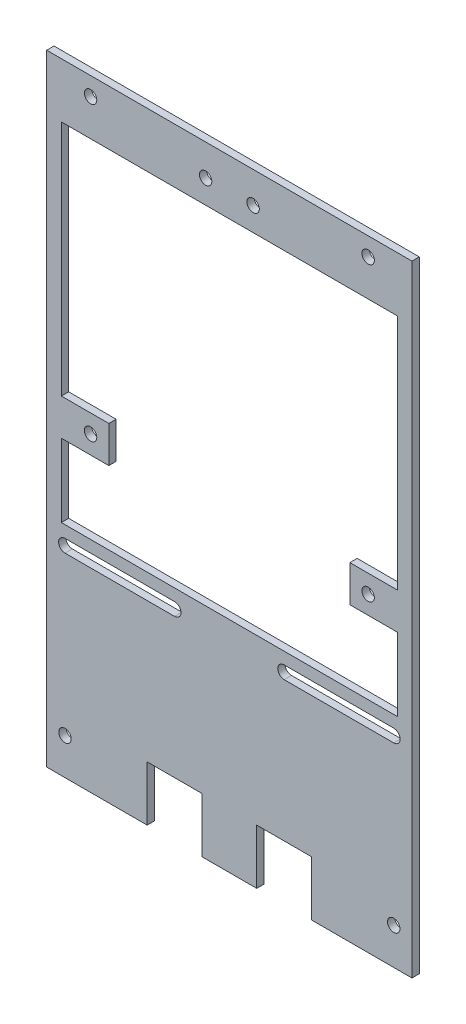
from build123d import *

# Parameters (mm, degrees)
SKETCH_1_W              = 100
SKETCH_1_H              = 170
EXTRUDE_1_DEPTH         = 2
SKETCH_2_W              = 15
SKETCH_2_H              = 30
CUT_EXTRUDE_1_DEPTH     = 3
HOLE_WIZARD_3_4_3_4_1_D = 3.4
HOLE_WIZARD_3_4_3_4_2_D = 3.4
HOLE_WIZARD_3_4_3_4_3_D = 3.4
CUT_EXTRUDE_2_REACH     = 100.636
CUT_EXTRUDE_3_REACH     = 100.636


with BuildPart() as part:
    # Sketch 1 → Extrude 1 (new body)
    with BuildSketch(Plane.XY):
        Rectangle(SKETCH_1_W, SKETCH_1_H)
    extrude(amount=EXTRUDE_1_DEPTH)

    # Sketch 2 → Cut-Extrude 1 (cut)
    with BuildSketch(Plane.XY.offset(2)):
        with Locations((-15, -85)):
            Rectangle(SKETCH_2_W, SKETCH_2_H)
        with Locations((15, -85)):
            Rectangle(SKETCH_2_W, SKETCH_2_H)
    extrude(amount=-CUT_EXTRUDE_1_DEPTH, mode=Mode.SUBTRACT)

    # Hole Wizard 3.4 _3.4_ _1 (through all)
    with Locations(Plane.XY.offset(2)):
        with Locations((-6.499991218, 76.443638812), (6.500008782, 76.443638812)):
            Hole(HOLE_WIZARD_3_4_3_4_1_D / 2)

    # Hole Wizard 3.4 _3.4_ _2 (through all)
    with Locations(Plane.XY.offset(2)):
        with Locations((-45, -75), (45, -75)):
            Hole(HOLE_WIZARD_3_4_3_4_2_D / 2)

    # Hole Wizard 3.4 _3.4_ _3 (through all)
    with Locations(Plane.XY.offset(2)):
        with Locations((-38, 80), (38, 80), (-38, 0), (38, 0)):
            Hole(HOLE_WIZARD_3_4_3_4_3_D / 2)

    # Sketch 9 → Cut-Extrude 2 (cut, up to next)
    with BuildSketch(Plane.XY.offset(2), mode=Mode.PRIVATE) as cut_extrude_2_sk1:
        Polygon((-46, 5), (-33, 5), (33, 5), (46, 5), (46, 70), (33, 70), (-33, 70), (-46, 70), align=None)
    cut_extrude_2_tool1 = extrude(cut_extrude_2_sk1.sketch, amount=-CUT_EXTRUDE_2_REACH, mode=Mode.PRIVATE) & part.part
    # Sketch 9 → Cut-Extrude 2 (cut, up to next)
    with BuildSketch(Plane.XY.offset(2), mode=Mode.PRIVATE) as cut_extrude_2_sk2:
        Polygon((-33, -5), (-46, -5), (-46, -25), (46, -25), (46, -5), (33, -5), (33, 5), (-33, 5), align=None)
    cut_extrude_2_tool2 = extrude(cut_extrude_2_sk2.sketch, amount=-CUT_EXTRUDE_2_REACH, mode=Mode.PRIVATE) & part.part
    add(cut_extrude_2_tool1.solids().sort_by_distance((0, 37.5, 2))[0], mode=Mode.SUBTRACT)
    add(cut_extrude_2_tool2.solids().sort_by_distance((0, -11.04, 2))[0], mode=Mode.SUBTRACT)

    # Sketch 10 → Cut-Extrude 3 (cut, up to next)
    with BuildSketch(Plane.XY.offset(2), mode=Mode.PRIVATE) as cut_extrude_3_sk1:
        with BuildLine():
            Line((-45, -28.25), (-15, -28.25))
            ThreePointArc((-15, -28.25), (-13.25, -30), (-15, -31.75))
            Line((-15, -31.75), (-45, -31.75))
            ThreePointArc((-45, -31.75), (-46.75, -30), (-45, -28.25))
        make_face()
    cut_extrude_3_tool1 = extrude(cut_extrude_3_sk1.sketch, amount=-CUT_EXTRUDE_3_REACH, mode=Mode.PRIVATE) & part.part
    # Sketch 10 → Cut-Extrude 3 (cut, up to next)
    with BuildSketch(Plane.XY.offset(2), mode=Mode.PRIVATE) as cut_extrude_3_sk2:
        with BuildLine():
            Line((15, -28.25), (45, -28.25))
            ThreePointArc((45, -28.25), (46.75, -30), (45, -31.75))
            Line((45, -31.75), (15, -31.75))
            ThreePointArc((15, -31.75), (13.25, -30), (15, -28.25))
        make_face()
    cut_extrude_3_tool2 = extrude(cut_extrude_3_sk2.sketch, amount=-CUT_EXTRUDE_3_REACH, mode=Mode.PRIVATE) & part.part
    add(cut_extrude_3_tool1.solids().sort_by_distance((-30, -30, 2))[0], mode=Mode.SUBTRACT)
    add(cut_extrude_3_tool2.solids().sort_by_distance((30, -30, 2))[0], mode=Mode.SUBTRACT)


solid = part.part
